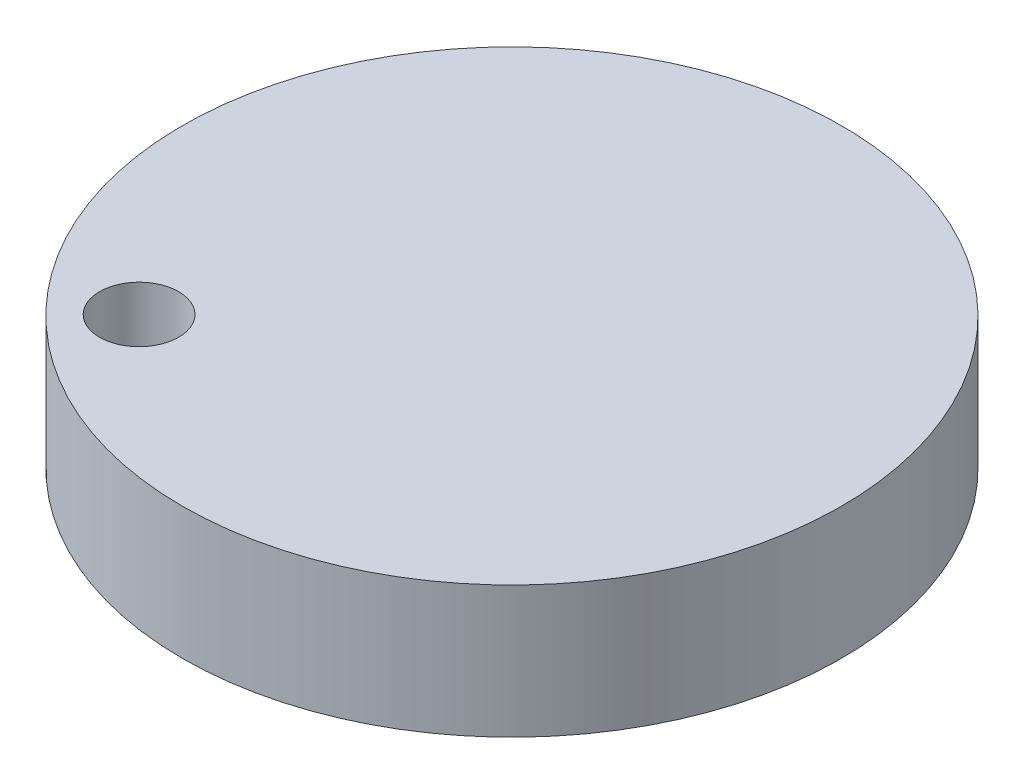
from build123d import *

# Parameters (mm, degrees)
SKETCH1_R               = 12.5
BOSS_EXTRUDE1_DEPTH     = 5
BOSS_EXTRUDE2_DEPTH     = 2
CUT_EXTRUDE1_DEPTH      = 19.371173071
CUT_EXTRUDE1_DEPTH_BACK = 19.371173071
SKETCH7_R               = 1.5


with BuildPart() as part:
    # Sketch1 → Boss-Extrude1 (new body)
    with BuildSketch(Plane(origin=(0, 0, 0), x_dir=(1, 0, 0), z_dir=(0, 1, 0))):
        with Locations(Location((0, 0, 0), (0, 0, 270))):
            Circle(SKETCH1_R)
    extrude(amount=BOSS_EXTRUDE1_DEPTH)

    # Sketch5 → Boss-Extrude2 (add)
    with BuildSketch(Plane.XZ):
        with BuildLine():
            ThreePointArc((0.151933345, 9.240024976), (7.241529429, -4.84837498), (-7.728040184, 0.117243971))
            ThreePointArc((-7.728040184, 0.117243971), (4.587114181, -2.555573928), (0.151933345, 9.240024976))
        make_face()
        with BuildLine():
            ThreePointArc((-3.656517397, -6.557691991), (-5.001923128, -5.543170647), (-6.121751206, -4.284061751))
            Line((-6.121751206, -4.284061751), (-6.613956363, -5.53781326))
            Line((-6.613956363, -5.53781326), (-9.1213874, -7.458398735))
            Line((-9.1213874, -7.458398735), (-9.1213874, -7.938927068))
            Line((-9.1213874, -7.938927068), (-3.783058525, -7.938927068))
            Line((-3.783058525, -7.938927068), (-3.783058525, -7.698853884))
            Line((-3.783058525, -7.698853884), (-3.656517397, -6.557691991))
        make_face()
        with BuildLine():
            ThreePointArc((6.332224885, -5.753540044), (5.494878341, -6.385314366), (4.586346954, -6.909584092))
            Line((4.586346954, -6.909584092), (4.398231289, -7.803613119))
            Line((4.398231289, -7.803613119), (8.835264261, -7.803613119))
            Line((8.835264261, -7.803613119), (8.835264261, -7.356598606))
            Line((8.835264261, -7.356598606), (6.332224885, -5.753540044))
        make_face()
        with BuildLine():
            ThreePointArc((-0.950626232, 8.887896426), (2.400955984, -1.341013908), (-7.728040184, 2.301395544))
            ThreePointArc((-7.728040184, 2.301395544), (2.870290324, -1.823952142), (-0.950626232, 8.887896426))
        make_face()
        with BuildLine():
            ThreePointArc((-5.206948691, -1.953864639), (-4.267011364, -2.491822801), (-3.245572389, -2.851744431))
            Line((-3.245572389, -2.851744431), (-3.200349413, -2.443918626))
            Line((-3.200349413, -2.443918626), (0.032158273, 5.78996786))
            Line((0.032158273, 5.78996786), (2.539505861, -1.201879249))
            ThreePointArc((2.539505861, -1.201879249), (3.172462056, -0.424101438), (3.666799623, 0.448367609))
            Line((3.666799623, 0.448367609), (0.151933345, 8.626753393))
            ThreePointArc((0.151933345, 8.626753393), (-0.393157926, 8.783453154), (-0.950626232, 8.887896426))
            Line((-0.950626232, 8.887896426), (-5.206948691, -1.953864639))
        make_face()
        with BuildLine():
            ThreePointArc((1.577176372, 0.117243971), (0.166068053, -1.570987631), (-1.245040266, 0.117243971))
            Line((-1.245040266, 0.117243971), (0.032158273, 3.12312116))
            Line((0.032158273, 3.12312116), (1.577176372, 0.117243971))
        make_face()
    extrude(amount=BOSS_EXTRUDE2_DEPTH)

    # Sketch7 → Cut-Extrude1 (cut, two sides: drawn at the far end of the back side and taken through both)
    with BuildSketch(Plane.XZ.offset(-CUT_EXTRUDE1_DEPTH_BACK)):
        with Locations(Location((-7.119157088, 7.022649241, 0), (0, 0, 270))):
            Circle(SKETCH7_R)
    extrude(amount=CUT_EXTRUDE1_DEPTH + CUT_EXTRUDE1_DEPTH_BACK, mode=Mode.SUBTRACT)


solid = part.part
